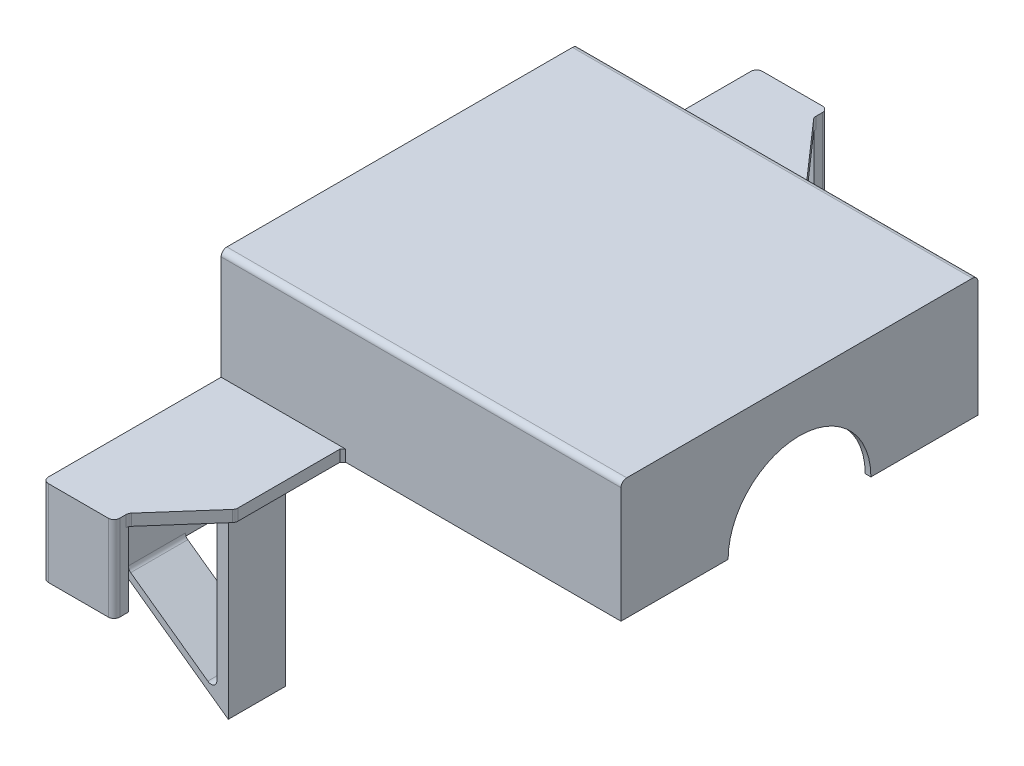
from build123d import *

# Parameters (mm, degrees)
SKETCH_1_W          = 140
SKETCH_1_H          = 125
EXTRUDE_1_DEPTH     = 42.5
SHELL_1_T           = -2
EXTRUDE_2_DEPTH     = 4
SKETCH_5_W          = 198
SKETCH_5_H          = 34
EXTRUDE_4_DEPTH     = 4
CHAMFER_1_SIZE      = 1
FILLET_1_R          = 2
EXTRUDE_5_DEPTH     = 20
SKETCH_7_W          = 5
SKETCH_7_H          = 30
EXTRUDE_6_DEPTH     = 25
FILLET_2_R          = 2
CUT_EXTRUDE_1_REACH = 199.659
SKETCH_8_R          = 25


with BuildPart() as part:
    # Sketch 1 → Extrude 1 (new body)
    with BuildSketch(Plane(origin=(0, 0, 0), x_dir=(1, 0, 0), z_dir=(0, 1, 0))):
        Rectangle(SKETCH_1_W, SKETCH_1_H)
    extrude(amount=EXTRUDE_1_DEPTH)

    # Shell 1
    shell_1_openings = [part.faces().sort_by_distance(p)[0] for p in [
        (0, 0, 0),
    ]]
    offset(amount=SHELL_1_T, openings=shell_1_openings, kind=Kind.INTERSECTION)

    # Sketch 4 → Extrude 2 (add)
    with BuildSketch(Plane.XZ):
        Polygon((-70, 62.5), (-70, 120), (-45, 120), (-27.4, 100), (-27.4, 62.5), align=None)
    extrude_2 = extrude(amount=-EXTRUDE_2_DEPTH)

    # Mirror 1: Extrude 2 across plane
    add(extrude_2.mirror(Plane.XY))

    # Sketch 5 → Extrude 4 (add)
    with BuildSketch(Plane.ZY.offset(70)):
        with Locations((0, -17)):
            Rectangle(SKETCH_5_W, SKETCH_5_H)
    extrude(amount=-EXTRUDE_4_DEPTH)

    # Chamfer 1
    chamfer_1_edges = [part.edges().sort_by_distance(p)[0] for p in [
        (-68, 0, 0),
        (-68, 40.5, 0),
        (68, 40.5, 0),
        (-27.4, 2, 62.5),
        (-27.4, 2, -62.5),
    ]]
    chamfer(chamfer_1_edges, length=CHAMFER_1_SIZE)

    # Fillet 1
    fillet_1_edges = [part.edges().sort_by_distance(p)[0] for p in [
        (0, 42.5, -62.5),
        (0, 42.5, 62.5),
    ]]
    fillet(fillet_1_edges, radius=FILLET_1_R)

    # Sketch 6 → Extrude 5 (add)
    with BuildSketch(Plane.XY.offset(99)):
        Polygon((-70, -34), (-66, -34), (-35, -56.256410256), (-35, 0), (-31, 0), (-31, -59.261737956), (-31, -62), align=None)
    extrude_5 = extrude(amount=-EXTRUDE_5_DEPTH)

    # Sketch 7 → Extrude 6 (add)
    with BuildSketch(Plane.ZY.offset(70)):
        with Locations((-122.5, -11)):
            Rectangle(SKETCH_7_W, SKETCH_7_H)
    extrude_6 = extrude(amount=-EXTRUDE_6_DEPTH)

    # Mirror 2: Extrude 5, Extrude 6 across plane
    add(extrude_5.mirror(Plane.XY))
    add(extrude_6.mirror(Plane.XY))

    # Fillet 2
    fillet_2_edges = [part.edges().sort_by_distance(p)[0] for p in [
        (-35, -56.256410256, 89),
        (-45, -11, -125),
        (-70, -11, -125),
        (-35, -56.256410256, -89),
        (-66, -34, -89),
        (-70, -11, 125),
        (-45, -11, 125),
        (-45, 2, 120),
        (-27.4, 2, 100),
        (-27.4, 2, -100),
        (-45, 2, -120),
        (-66, -34, 89),
    ]]
    fillet(fillet_2_edges, radius=FILLET_2_R)

    # Sketch 8 → Cut-Extrude 1 (cut, up to next)
    with BuildSketch(Plane(origin=(70, 0, 0), x_dir=(0, 0, -1), z_dir=(1, 0, 0)), mode=Mode.PRIVATE) as cut_extrude_1_sk1:
        Circle(SKETCH_8_R)
    cut_extrude_1_tool1 = extrude(cut_extrude_1_sk1.sketch, amount=-CUT_EXTRUDE_1_REACH, mode=Mode.PRIVATE) & part.part
    add(cut_extrude_1_tool1.solids().sort_by_distance((70, 0, 0))[0], mode=Mode.SUBTRACT)


solid = part.part
